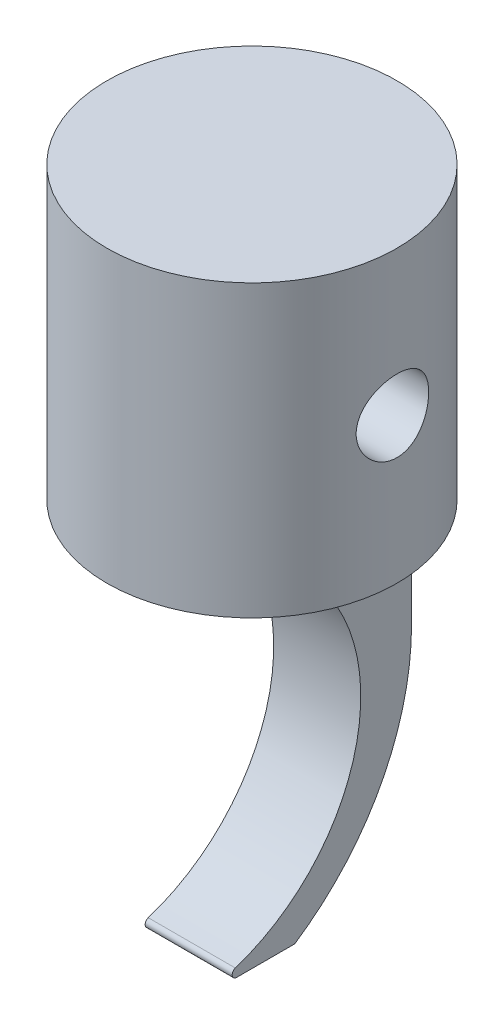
from build123d import *

# Parameters (mm, degrees)
SKETCH1_R                = 10
BOSS_EXTRUDE1_DEPTH      = 20
BOSS_EXTRUDE2_DEPTH      = 3
BOSS_EXTRUDE2_DEPTH_BACK = 3
CUT_EXTRUDE1_DEPTH       = 29.722813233
CUT_EXTRUDE1_DEPTH_BACK  = 29.722813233
SKETCH3_R                = 2.5


with BuildPart() as part:
    # Sketch1 → Boss-Extrude1 (new body)
    with BuildSketch(Plane(origin=(0, 0, 0), x_dir=(1, 0, 0), z_dir=(0, 1, 0))):
        with Locations(Location((0, 0, 0), (0, 0, 270))):
            Circle(SKETCH1_R)
    extrude(amount=BOSS_EXTRUDE1_DEPTH)

    # Sketch2 → Boss-Extrude2 (add, two sides: drawn at the far end of the back side and taken through both)
    with BuildSketch(Plane(origin=(0, 0, 0), x_dir=(0, 0, -1), z_dir=(1, 0, 0)).offset(-BOSS_EXTRUDE2_DEPTH_BACK)):
        with BuildLine():
            Line((-8, 0), (8, 0))
            Line((8, 0), (8, -10))
            ThreePointArc((8, -10), (5.860292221, -18.511822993), (-0.050125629, -25))
            Line((-0.050125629, -25), (-4.050125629, -25))
            ThreePointArc((-4.050125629, -25), (-4.358332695, -24.736665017), (-4.146322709, -24.391138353))
            ThreePointArc((-4.146322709, -24.391138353), (4.346846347, -10.549260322), (-8, 0))
        make_face()
    extrude(amount=BOSS_EXTRUDE2_DEPTH + BOSS_EXTRUDE2_DEPTH_BACK)

    # Sketch3 → Cut-Extrude1 (cut, two sides: drawn at the far end of the back side and taken through both)
    with BuildSketch(Plane(origin=(0, 0, 0), x_dir=(0, 0, -1), z_dir=(1, 0, 0)).offset(-CUT_EXTRUDE1_DEPTH_BACK)):
        with Locations((0, 10)):
            Circle(SKETCH3_R)
    extrude(amount=CUT_EXTRUDE1_DEPTH + CUT_EXTRUDE1_DEPTH_BACK, mode=Mode.SUBTRACT)


solid = part.part
